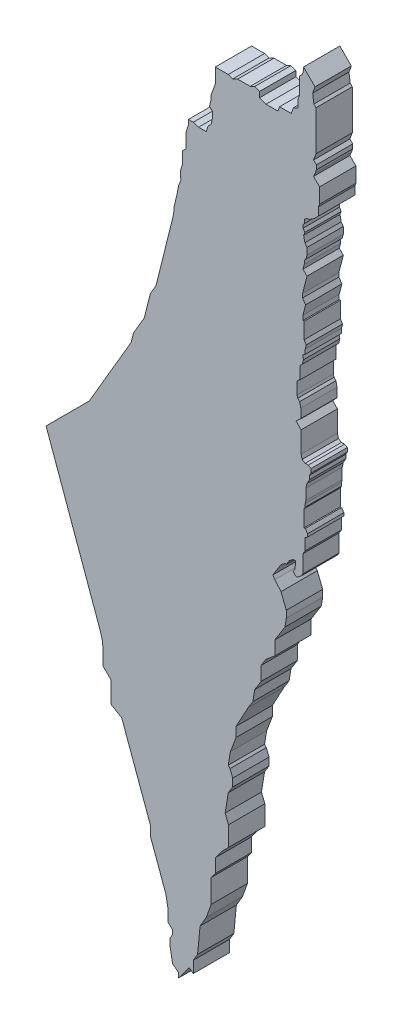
from build123d import *

# Parameters (mm, degrees)
BOSS_EXTRUDE1_DEPTH = 3
SCALE1_SCALE        = 1.5
SCALE2_SCALE        = 1.5


with BuildPart() as part:
    # Sketch2 → Boss-Extrude1 (new body)
    with BuildSketch(Plane.XY):
        with BuildLine():
            Line((-16.311662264, 33.088256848), (-11.817568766, 20.622497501))
            ThreePointArc((-11.817568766, 20.622497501), (-11.664361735, 20.045436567), (-11.61277937, 19.450616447))
            Line((-11.61277937, 19.450616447), (-11.61277937, 18.268448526))
            Line((-11.61277937, 18.268448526), (-10.966158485, 17.621827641))
            Line((-10.966158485, 17.621827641), (-10.966158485, 16.877419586))
            Line((-10.966158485, 16.877419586), (-10.966158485, 16.342408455))
            Line((-10.966158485, 16.342408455), (-10.966158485, 15.860898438))
            Line((-10.966158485, 15.860898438), (-10.061858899, 15.327489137))
            Line((-10.061858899, 15.327489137), (-8.971981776, 12.340898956))
            Line((-8.971981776, 12.340898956), (-7.69854774, 8.851307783))
            Line((-7.69854774, 8.851307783), (-7.69854774, 8.058330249))
            Line((-7.69854774, 8.058330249), (-6.413319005, 4.536418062))
            Line((-6.413319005, 4.536418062), (-6.257998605, 3.671133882))
            Line((-6.257998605, 3.671133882), (-6.257998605, 2.646619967))
            Line((-6.257998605, 2.646619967), (-5.855510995, 2.244132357))
            Line((-5.855510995, 2.244132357), (-5.855510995, 1.939217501))
            Line((-5.855510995, 1.939217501), (-6.0567548, 1.598044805))
            Line((-6.0567548, 1.598044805), (-6.0567548, 0.939096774))
            Line((-6.0567548, 0.939096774), (-5.855510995, -0.182024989))
            Line((-5.855510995, -0.182024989), (-5.623775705, -0.353742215))
            Line((-5.623775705, -0.353742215), (-5.365369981, -0.54522239))
            Line((-5.365369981, -0.54522239), (-5.365369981, -0.939178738))
            Line((-5.365369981, -0.939178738), (-4.8679363, -0.267883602))
            Line((-4.8679363, -0.267883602), (-4.490917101, 0.240910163))
            Line((-4.490917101, 0.240910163), (-4.14760422, -0.01348672))
            Line((-4.14760422, -0.01348672), (-4.14760422, 0.939096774))
            Line((-4.14760422, 0.939096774), (-3.799674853, 1.528948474))
            Line((-3.799674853, 1.528948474), (-3.709049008, 2.445376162))
            Line((-3.709049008, 2.445376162), (-3.661526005, 2.925938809))
            Line((-3.661526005, 2.925938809), (-3.587833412, 3.671133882))
            Line((-3.587833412, 3.671133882), (-3.077437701, 4.536418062))
            Line((-3.077437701, 4.536418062), (-2.672199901, 5.671375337))
            Line((-2.672199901, 5.671375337), (-2.672199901, 7.598437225))
            Line((-2.672199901, 7.598437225), (-2.331416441, 8.058330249))
            Line((-2.331416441, 8.058330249), (-2.331416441, 9.183994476))
            Line((-2.331416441, 9.183994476), (-1.793908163, 9.909370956))
            Line((-1.793908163, 9.909370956), (-1.237858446, 10.465420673))
            Line((-1.237858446, 10.465420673), (-1.237858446, 11.256321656))
            Line((-1.237858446, 11.256321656), (-1.237858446, 12.090901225))
            Line((-1.237858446, 12.090901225), (-1.515883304, 12.789619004))
            Line((-1.515883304, 12.789619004), (-1.376870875, 13.643607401))
            Line((-1.376870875, 13.643607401), (-1.257924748, 14.374323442))
            Line((-1.257924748, 14.374323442), (-0.889452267, 14.96340765))
            Line((-0.889452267, 14.96340765), (-0.889452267, 15.603898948))
            Line((-0.889452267, 15.603898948), (-1.114569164, 16.169651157))
            Line((-1.114569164, 16.169651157), (-1.257924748, 16.342408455))
            Line((-1.257924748, 16.342408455), (-1.087149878, 17.391521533))
            Line((-1.087149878, 17.391521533), (-0.609468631, 18.645629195))
            Line((-0.609468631, 18.645629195), (-0.609468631, 19.450616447))
            Line((-0.609468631, 19.450616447), (0.368785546, 21.256477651))
            Line((0.368785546, 21.256477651), (0.769569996, 21.897219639))
            Line((0.769569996, 21.897219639), (0.923251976, 22.841326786))
            Line((0.923251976, 22.841326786), (1.458685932, 23.697335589))
            Line((1.458685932, 23.697335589), (1.458685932, 24.840875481))
            Line((1.458685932, 24.840875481), (1.858889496, 25.480688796))
            Line((1.858889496, 25.480688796), (2.587973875, 26.085689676))
            Line((2.587973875, 26.085689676), (2.587973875, 27.228553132))
            Line((2.587973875, 27.228553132), (3.425947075, 28.56823738))
            Line((3.425947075, 28.56823738), (3.538142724, 29.257483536))
            Line((3.538142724, 29.257483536), (3.538142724, 29.825276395))
            Line((3.538142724, 29.825276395), (3.301279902, 30.42054786))
            Line((3.301279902, 30.42054786), (3.096431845, 30.935361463))
            Line((3.096431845, 30.935361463), (2.587973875, 31.54810233))
            Line((2.587973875, 31.54810233), (2.415159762, 31.781680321))
            Line((2.415159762, 31.781680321), (2.84220286, 32.464402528))
            Line((2.84220286, 32.464402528), (3.096431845, 32.87084341))
            Line((3.096431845, 32.87084341), (3.419711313, 33.110023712))
            Line((3.419711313, 33.110023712), (3.538142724, 33.110023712))
            Line((3.538142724, 33.110023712), (3.787349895, 33.508436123))
            Line((3.787349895, 33.508436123), (4.104193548, 33.742854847))
            Line((4.104193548, 33.742854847), (4.286214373, 33.742854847))
            Line((4.286214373, 33.742854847), (4.286214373, 33.414238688))
            Line((4.286214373, 33.414238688), (4.236694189, 33.110023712))
            Line((4.236694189, 33.110023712), (4.104193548, 32.898192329))
            Line((4.104193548, 32.898192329), (4.274781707, 32.667622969))
            Line((4.274781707, 32.667622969), (4.427867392, 32.642703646))
            Line((4.427867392, 32.642703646), (4.617369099, 32.782907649))
            Line((4.617369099, 32.782907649), (4.773189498, 32.898192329))
            Line((4.773189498, 32.898192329), (4.905690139, 33.110023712))
            Line((4.905690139, 33.110023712), (4.905690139, 33.414238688))
            Line((4.905690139, 33.414238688), (4.905690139, 33.742854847))
            Line((4.905690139, 33.742854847), (4.905690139, 34.207624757))
            Line((4.905690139, 34.207624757), (4.905690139, 34.550365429))
            Line((4.905690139, 34.550365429), (5.098769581, 34.859045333))
            Line((5.098769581, 34.859045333), (5.098769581, 35.114879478))
            Line((5.098769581, 35.114879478), (5.098769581, 35.497942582))
            Line((5.098769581, 35.497942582), (5.098769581, 35.800360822))
            Line((5.098769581, 35.800360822), (5.294211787, 35.941489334))
            Line((5.294211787, 35.941489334), (5.294211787, 36.183423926))
            Line((5.294211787, 36.183423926), (5.098769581, 36.454082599))
            Line((5.098769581, 36.454082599), (5.00222986, 36.454082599))
            Line((5.00222986, 36.454082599), (5.00222986, 37.816482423))
            Line((5.00222986, 37.816482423), (5.098769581, 37.986755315))
            Line((5.098769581, 37.986755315), (5.098769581, 38.018521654))
            Line((5.098769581, 38.018521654), (5.098769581, 38.240886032))
            Line((5.098769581, 38.240886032), (5.154747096, 38.487075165))
            Line((5.154747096, 38.487075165), (5.154747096, 39.366786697))
            Line((5.154747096, 39.366786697), (5.240832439, 39.745390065))
            Line((5.240832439, 39.745390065), (5.456465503, 40.125715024))
            Line((5.456465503, 40.125715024), (5.456465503, 40.447170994))
            Line((5.456465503, 40.447170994), (5.575238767, 40.65665852))
            Line((5.575238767, 40.65665852), (5.575238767, 40.987363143))
            Line((5.575238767, 40.987363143), (5.348648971, 41.115832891))
            Line((5.348648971, 41.115832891), (5.098769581, 41.115832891))
            Line((5.098769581, 41.115832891), (4.839439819, 41.262865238))
            Line((4.839439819, 41.262865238), (4.759479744, 41.600969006))
            Line((4.759479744, 41.600969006), (4.759479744, 41.786581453))
            Line((4.759479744, 41.786581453), (4.759479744, 42.028811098))
            Line((4.759479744, 42.028811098), (4.759479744, 42.301319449))
            Line((4.759479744, 42.301319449), (4.759479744, 42.574945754))
            Line((4.759479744, 42.574945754), (4.759479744, 42.876614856))
            Line((4.759479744, 42.876614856), (4.759479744, 43.149123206))
            Line((4.759479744, 43.149123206), (4.759479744, 43.347828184))
            Line((4.759479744, 43.347828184), (4.345233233, 43.762074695))
            Line((4.345233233, 43.762074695), (4.638199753, 44.055041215))
            ThreePointArc((4.638199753, 44.055041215), (4.703154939, 44.081946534), (4.730060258, 44.146901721))
            Line((4.730060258, 44.146901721), (4.730060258, 44.528898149))
            Line((4.730060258, 44.528898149), (4.730060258, 44.885587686))
            Line((4.730060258, 44.885587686), (4.638199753, 45.299033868))
            Line((4.638199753, 45.299033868), (4.474981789, 45.462251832))
            Line((4.474981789, 45.462251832), (4.427867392, 45.674304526))
            Line((4.427867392, 45.674304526), (4.427867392, 46.012625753))
            Line((4.427867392, 46.012625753), (4.427867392, 46.312903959))
            Line((4.427867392, 46.312903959), (4.427867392, 46.673527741))
            Line((4.427867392, 46.673527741), (4.617369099, 46.863029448))
            Line((4.617369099, 46.863029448), (4.659030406, 46.863029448))
            Line((4.659030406, 46.863029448), (4.659030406, 47.102724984))
            Line((4.659030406, 47.102724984), (4.659030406, 47.288199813))
            Line((4.659030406, 47.288199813), (4.659030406, 47.662877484))
            Line((4.659030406, 47.662877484), (4.659030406, 47.889767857))
            Line((4.659030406, 47.889767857), (4.861951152, 48.092688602))
            Line((4.861951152, 48.092688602), (4.955831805, 48.457104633))
            Line((4.955831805, 48.457104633), (4.885615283, 48.773135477))
            Line((4.885615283, 48.773135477), (5.095048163, 48.912364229))
            Line((5.095048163, 48.912364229), (5.095048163, 49.281238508))
            Line((5.095048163, 49.281238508), (5.18623408, 49.635194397))
            Line((5.18623408, 49.635194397), (5.003862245, 49.909524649))
            Line((5.003862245, 49.909524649), (5.003862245, 50.208672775))
            Line((5.003862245, 50.208672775), (5.003862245, 50.507820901))
            Line((5.003862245, 50.507820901), (5.003862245, 50.72134376))
            Line((5.003862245, 50.72134376), (5.003862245, 51.006401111))
            Line((5.003862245, 51.006401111), (5.003862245, 51.239060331))
            Line((5.003862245, 51.239060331), (4.907801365, 51.239060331))
            Line((4.907801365, 51.239060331), (4.907801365, 51.618452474))
            Line((4.907801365, 51.618452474), (5.003862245, 51.991331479))
            Line((5.003862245, 51.991331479), (5.126833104, 52.468666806))
            Line((5.126833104, 52.468666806), (4.880891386, 52.838621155))
            Line((4.880891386, 52.838621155), (4.880891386, 53.163469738))
            Line((4.880891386, 53.163469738), (4.98835996, 53.58062993))
            Line((4.98835996, 53.58062993), (5.125075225, 54.111316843))
            Line((5.125075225, 54.111316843), (5.247392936, 54.586116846))
            Line((5.247392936, 54.586116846), (4.914986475, 54.918523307))
            Line((4.914986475, 54.918523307), (5.018851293, 55.321694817))
            Line((5.018851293, 55.321694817), (5.018851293, 55.611964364))
            Line((5.018851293, 55.611964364), (5.156355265, 55.749468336))
            Line((5.156355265, 55.749468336), (5.240832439, 56.077382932))
            Line((5.240832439, 56.077382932), (5.240832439, 56.63274136))
            Line((5.240832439, 56.63274136), (5.071878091, 56.886888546))
            Line((5.071878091, 56.886888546), (4.965824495, 57.364215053))
            Line((4.965824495, 57.364215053), (5.071878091, 57.627647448))
            Line((5.071878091, 57.627647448), (4.921718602, 57.853522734))
            Line((4.921718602, 57.853522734), (4.921718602, 58.125632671))
            Line((4.921718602, 58.125632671), (5.027671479, 58.231585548))
            Line((5.027671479, 58.231585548), (5.027671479, 58.558796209))
            Line((5.027671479, 58.558796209), (5.240832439, 58.70050335))
            Line((5.240832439, 58.70050335), (5.456465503, 58.748413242))
            Line((5.456465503, 58.748413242), (5.716067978, 58.920994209))
            Line((5.716067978, 58.920994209), (5.849878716, 59.009950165))
            Line((5.849878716, 59.009950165), (6.038031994, 59.198103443))
            Line((6.038031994, 59.198103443), (6.194583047, 59.354654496))
            Line((6.194583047, 59.354654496), (6.194583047, 59.554805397))
            Line((6.194583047, 59.554805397), (6.194583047, 59.788314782))
            Line((6.194583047, 59.788314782), (6.194583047, 60.021824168))
            Line((6.194583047, 60.021824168), (6.287738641, 60.253218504))
            Line((6.287738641, 60.253218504), (6.287738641, 60.765756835))
            Line((6.287738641, 60.765756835), (6.287738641, 61.228145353))
            Line((6.287738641, 61.228145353), (6.287738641, 61.492054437))
            Line((6.287738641, 61.492054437), (6.038031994, 61.741761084))
            Line((6.038031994, 61.741761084), (5.788325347, 61.991467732))
            Line((5.788325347, 61.991467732), (5.906311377, 62.261981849))
            Line((5.906311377, 62.261981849), (6.022183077, 62.580986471))
            Line((6.022183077, 62.580986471), (6.022183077, 62.934260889))
            Line((6.022183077, 62.934260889), (5.788325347, 63.168118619))
            Line((5.788325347, 63.168118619), (5.985253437, 63.710278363))
            Line((5.985253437, 63.710278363), (5.985253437, 64.051081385))
            Line((5.985253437, 64.051081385), (5.985253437, 64.482333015))
            Line((5.985253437, 64.482333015), (5.985253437, 64.832915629))
            Line((5.985253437, 64.832915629), (5.985253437, 65.024794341))
            Line((5.985253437, 65.024794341), (5.985253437, 65.192728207))
            Line((5.985253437, 65.192728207), (5.985253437, 65.573714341))
            Line((5.985253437, 65.573714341), (5.985253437, 65.822778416))
            Line((5.985253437, 65.822778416), (5.985253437, 66.284830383))
            Line((5.985253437, 66.284830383), (5.985253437, 66.680635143))
            Line((5.985253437, 66.680635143), (5.985253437, 67.002654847))
            Line((5.985253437, 67.002654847), (5.810418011, 67.177490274))
            Line((5.810418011, 67.177490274), (5.771994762, 67.482278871))
            Line((5.771994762, 67.482278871), (5.716067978, 67.925912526))
            Line((5.716067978, 67.925912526), (5.827921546, 68.233854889))
            Line((5.827921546, 68.233854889), (5.908785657, 68.456480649))
            Line((5.908785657, 68.456480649), (5.747057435, 68.618208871))
            Line((5.747057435, 68.618208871), (5.348648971, 69.016617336))
            Line((5.348648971, 69.016617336), (4.958200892, 69.407065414))
            Line((4.958200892, 69.407065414), (4.958200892, 69.129499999))
            Line((4.958200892, 69.129499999), (4.839439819, 68.802540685))
            Line((4.839439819, 68.802540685), (4.617369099, 68.580469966))
            Line((4.617369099, 68.580469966), (4.617369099, 68.332491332))
            Line((4.617369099, 68.332491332), (4.617369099, 68.049087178))
            Line((4.617369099, 68.049087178), (4.617369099, 67.623980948))
            Line((4.617369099, 67.623980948), (4.617369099, 67.340576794))
            Line((4.617369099, 67.340576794), (4.617369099, 67.177490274))
            Line((4.617369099, 67.177490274), (4.490358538, 66.827819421))
            Line((4.490358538, 66.827819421), (4.490358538, 66.241706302))
            Line((4.490358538, 66.241706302), (4.126706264, 66.071842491))
            Line((4.126706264, 66.071842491), (3.945771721, 65.573714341))
            Line((3.945771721, 65.573714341), (3.478927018, 65.573714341))
            Line((3.478927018, 65.573714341), (2.980588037, 65.573714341))
            Line((2.980588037, 65.573714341), (2.84220286, 65.192728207))
            Line((2.84220286, 65.192728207), (2.346574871, 65.192728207))
            Line((2.346574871, 65.192728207), (1.858889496, 65.192728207))
            Line((1.858889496, 65.192728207), (1.657548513, 65.265861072))
            Line((1.657548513, 65.265861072), (1.327900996, 65.385598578))
            Line((1.327900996, 65.385598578), (1.327900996, 65.843369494))
            Line((1.327900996, 65.843369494), (0.923251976, 65.990349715))
            Line((0.923251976, 65.990349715), (0.550520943, 65.81624517))
            Line((0.550520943, 65.81624517), (0.156279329, 65.81624517))
            Line((0.156279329, 65.81624517), (-0.261755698, 65.81624517))
            Line((-0.261755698, 65.81624517), (-0.48642745, 65.81624517))
            Line((-0.48642745, 65.81624517), (-0.889452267, 65.627990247))
            Line((-0.889452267, 65.627990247), (-1.257924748, 65.761830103))
            Line((-1.257924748, 65.761830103), (-1.662173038, 65.761830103))
            Line((-1.662173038, 65.761830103), (-2.331416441, 65.761830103))
            Line((-2.331416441, 65.761830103), (-2.331416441, 65.385598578))
            Line((-2.331416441, 65.385598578), (-2.331416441, 64.904858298))
            Line((-2.331416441, 64.904858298), (-2.331416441, 64.545216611))
            Line((-2.331416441, 64.545216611), (-2.565321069, 63.901257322))
            Line((-2.565321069, 63.901257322), (-2.704059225, 63.519299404))
            Line((-2.704059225, 63.519299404), (-2.704059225, 63.168118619))
            Line((-2.704059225, 63.168118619), (-2.804154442, 62.700403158))
            Line((-2.804154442, 62.700403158), (-2.565321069, 62.461569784))
            Line((-2.565321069, 62.461569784), (-2.565321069, 61.991467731))
            Line((-2.565321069, 61.991467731), (-2.672199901, 61.492054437))
            Line((-2.672199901, 61.492054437), (-2.936108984, 61.228145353))
            Line((-2.936108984, 61.228145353), (-3.077437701, 60.765756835))
            Line((-3.077437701, 60.765756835), (-3.587833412, 60.765756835))
            Line((-3.587833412, 60.765756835), (-3.709049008, 60.765756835))
            Line((-3.709049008, 60.765756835), (-4.14760422, 60.89980092))
            Line((-4.14760422, 60.89980092), (-4.552894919, 60.89980092))
            Line((-4.552894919, 60.89980092), (-4.552894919, 60.51474062))
            Line((-4.552894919, 60.51474062), (-4.74479548, 59.886895))
            Line((-4.74479548, 59.886895), (-4.74479548, 59.226304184))
            Line((-4.74479548, 59.226304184), (-4.74479548, 58.70050335))
            Line((-4.74479548, 58.70050335), (-5.03372332, 58.41157551))
            Line((-5.03372332, 58.41157551), (-5.03372332, 58.059260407))
            Line((-5.03372332, 58.059260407), (-5.03372332, 57.473092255))
            Line((-5.03372332, 57.473092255), (-5.204537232, 56.914236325))
            Line((-5.204537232, 56.914236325), (-5.204537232, 56.407783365))
            Line((-5.204537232, 56.407783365), (-5.160497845, 56.275665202))
            Line((-5.160497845, 56.275665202), (-5.366538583, 55.749468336))
            Line((-5.366538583, 55.749468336), (-5.50740974, 54.991672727))
            Line((-5.50740974, 54.991672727), (-5.72757848, 54.111316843))
            ThreePointArc((-5.72757848, 54.111316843), (-5.765237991, 53.633842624), (-5.855510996, 53.163469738))
            Line((-5.855510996, 53.163469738), (-6.106464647, 52.16001882))
            Line((-6.106464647, 52.16001882), (-6.46626377, 50.72134376))
            Line((-6.46626377, 50.72134376), (-6.876699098, 49.080197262))
            Line((-6.876699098, 49.080197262), (-7.231157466, 47.662877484))
            Line((-7.231157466, 47.662877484), (-7.69854774, 46.863029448))
            Line((-7.69854774, 46.863029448), (-7.995836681, 45.674304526))
            Line((-7.995836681, 45.674304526), (-8.193087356, 44.885587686))
            Line((-8.193087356, 44.885587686), (-8.624737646, 44.146901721))
            Line((-8.624737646, 44.146901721), (-9.091675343, 43.347828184))
            Line((-9.091675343, 43.347828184), (-9.284965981, 42.574945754))
            Line((-9.284965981, 42.574945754), (-9.854108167, 41.600969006))
            Line((-9.854108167, 41.600969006), (-10.337726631, 40.773349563))
            Line((-10.337726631, 40.773349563), (-10.966158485, 39.697910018))
            Line((-10.966158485, 39.697910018), (-11.817568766, 38.240886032))
            Line((-11.817568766, 38.240886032), (-12.743380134, 36.656538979))
            Line((-12.743380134, 36.656538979), (-13.901976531, 35.497942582))
            Line((-13.901976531, 35.497942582), (-16.311662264, 33.088256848))
        make_face()
    extrude(amount=BOSS_EXTRUDE1_DEPTH)


with BuildPart() as part_1:
    # Scale1: scaled about (-3.472016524, 35.83337933, 1.5)
    add(part.part.scale(SCALE1_SCALE).moved(Location((1.736008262, -17.916689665, -0.75))))


with BuildPart() as part_2:
    # Scale2: scaled about (-3.472016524, 35.83337933, 1.5)
    add(part_1.part.scale(SCALE2_SCALE).moved(Location((1.736008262, -17.916689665, -0.75))))


solid = part_2.part
